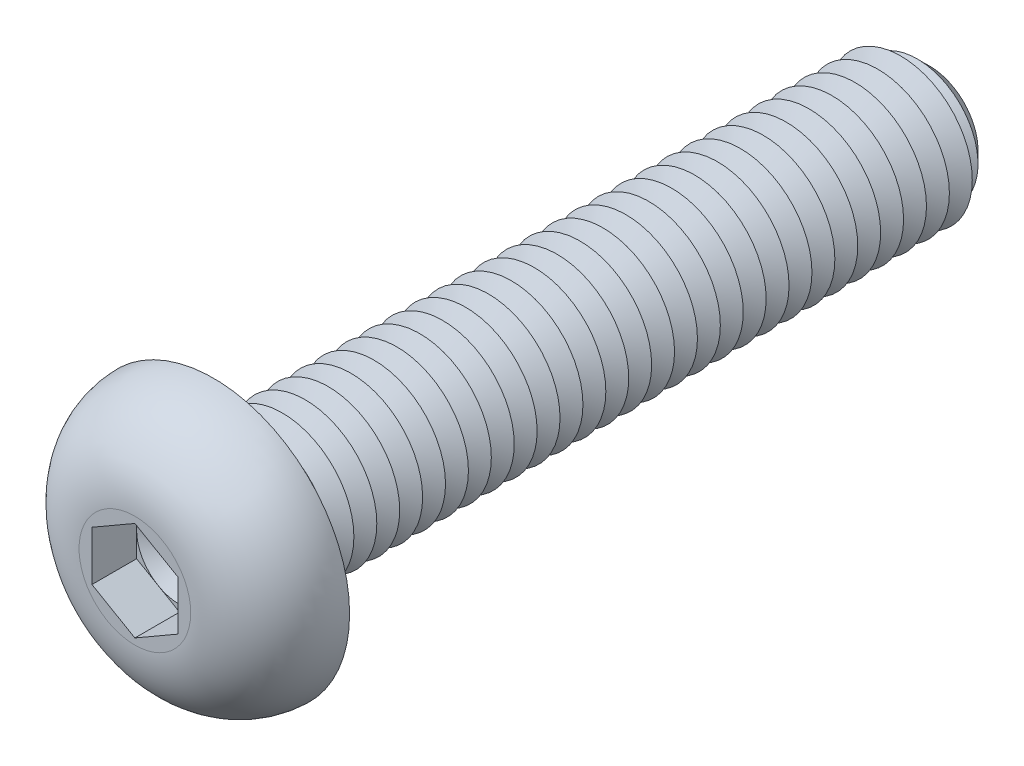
from build123d import *

# Parameters (mm, degrees)
CUT_EXTRUDE1_DEPTH  = 1.56
SKETCH4_R           = 2.5
BOSS_EXTRUDE1_DEPTH = 25
CHAMFER1_SIZE       = 0.8
LPATTERN1_COUNT     = 30
LPATTERN1_PITCH     = 0.8
FILLET2_R           = 0.4


with BuildPart() as part:
    # Sketch2 → Revolve1 (revolve)
    with BuildSketch(Plane(origin=(0, 0, 0), x_dir=(0, 0, -1), z_dir=(1, 0, 0)), mode=Mode.PRIVATE) as revolve1_sk:
        with BuildLine():
            Line((0, 0), (-2.75, 0))
            Line((-2.75, 0), (-2.75, 1.950446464))
            ThreePointArc((-2.75, 1.950446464), (-1.947498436, 3.912588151), (0, 4.75))
            Line((0, 4.75), (0, 0))
        make_face()
    revolve(revolve1_sk.sketch.rotate(Axis((0, 0, 47.934239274), (0, 0, -1)), 90), axis=Axis((0, 0, 47.934239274), (0, 0, -1)))

    # Sketch3 → Cut-Extrude1 (cut)
    with BuildSketch(Plane.XY.offset(2.75)):
        Polygon((0, 1.732050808), (-1.5, 0.866025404), (-1.5, -0.866025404), (0, -1.732050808), (1.5, -0.866025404), (1.5, 0.866025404), align=None)
    extrude(amount=-CUT_EXTRUDE1_DEPTH, mode=Mode.SUBTRACT)

    # Sketch4 → Boss-Extrude1 (add)
    with BuildSketch(Plane(origin=(0, 0, 0), x_dir=(-1, 0, 0), z_dir=(0, 0, -1))):
        with Locations(Location((0, 0, 0), (0, 0, 180))):
            Circle(SKETCH4_R)
    extrude(amount=BOSS_EXTRUDE1_DEPTH)

    # Chamfer1
    chamfer1_edges = [part.edges().sort_by_distance(p)[0] for p in [
        (-2.5, 0, -25),
    ]]
    chamfer(chamfer1_edges, length=CHAMFER1_SIZE)

    # Sketch5 → Cut-Revolve1 (revolve, cut)
    with BuildSketch(Plane(origin=(0, 0, 0), x_dir=(0, 0, -1), z_dir=(1, 0, 0)), mode=Mode.PRIVATE) as cut_revolve1_sk:
        Polygon((0.8, 2.5), (1.6, 2.5), (1.2, 1.807179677), align=None)
    cut_revolve1 = revolve(cut_revolve1_sk.sketch.rotate(Axis((0, 0, 47.934239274), (0, 0, -1)), 90), axis=Axis((0, 0, 47.934239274), (0, 0, -1)), mode=Mode.SUBTRACT)

    # LPattern1: Cut-Revolve1 ×30
    with Locations(*[(0, 0, -i * LPATTERN1_PITCH) for i in range(1, LPATTERN1_COUNT)]):
        add(cut_revolve1, mode=Mode.SUBTRACT)

    # Fillet2
    fillet2_edges = [part.edges().sort_by_distance(p)[0] for p in [
        (-2.5, 0, 0),
    ]]
    fillet(fillet2_edges, radius=FILLET2_R)

    # Cut-Extrude2 cone 1 section (on through the dimple's axis) → Cut-Extrude2 (revolve, cut)
    with BuildSketch(Plane(origin=(0, 0, 1.19), x_dir=(0, -1, 0), z_dir=(1, 0, 0))):
        Polygon((0, 0), (1.5, 0), (0, 0.866025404), align=None)
    revolve(axis=Axis((0, 0, 1.19), (0, 0, -1)), mode=Mode.SUBTRACT)


solid = part.part
